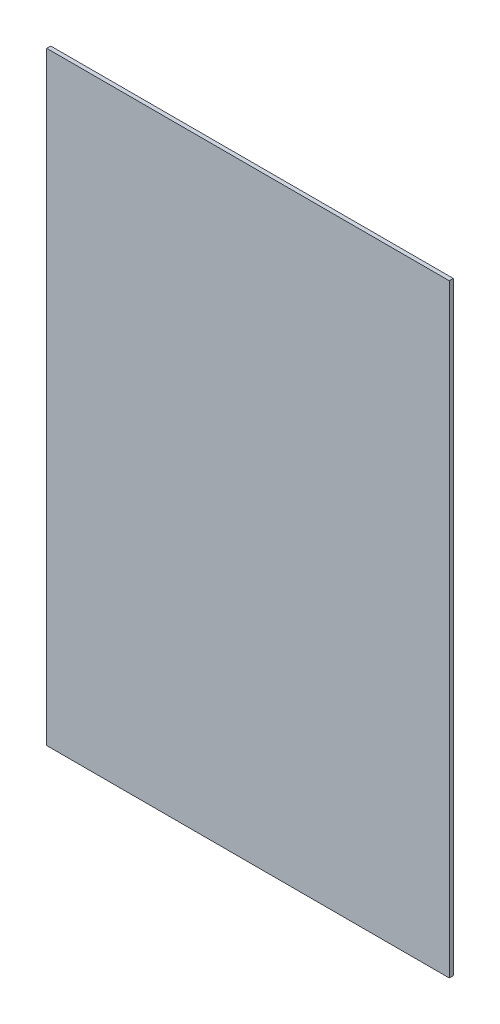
from build123d import *

# Parameters (mm, degrees)
SKIZZE1_W                       = 800
SKIZZE1_H                       = 1200
AUFSATZ_LINEAR_AUSTRAGEN1_DEPTH = 8


with BuildPart() as part:
    # Skizze1 → Aufsatz-Linear austragen1 (new body)
    with BuildSketch(Plane.XY):
        with Locations((275.511587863, 655.920524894)):
            Rectangle(SKIZZE1_W, SKIZZE1_H)
    extrude(amount=AUFSATZ_LINEAR_AUSTRAGEN1_DEPTH)


solid = part.part
